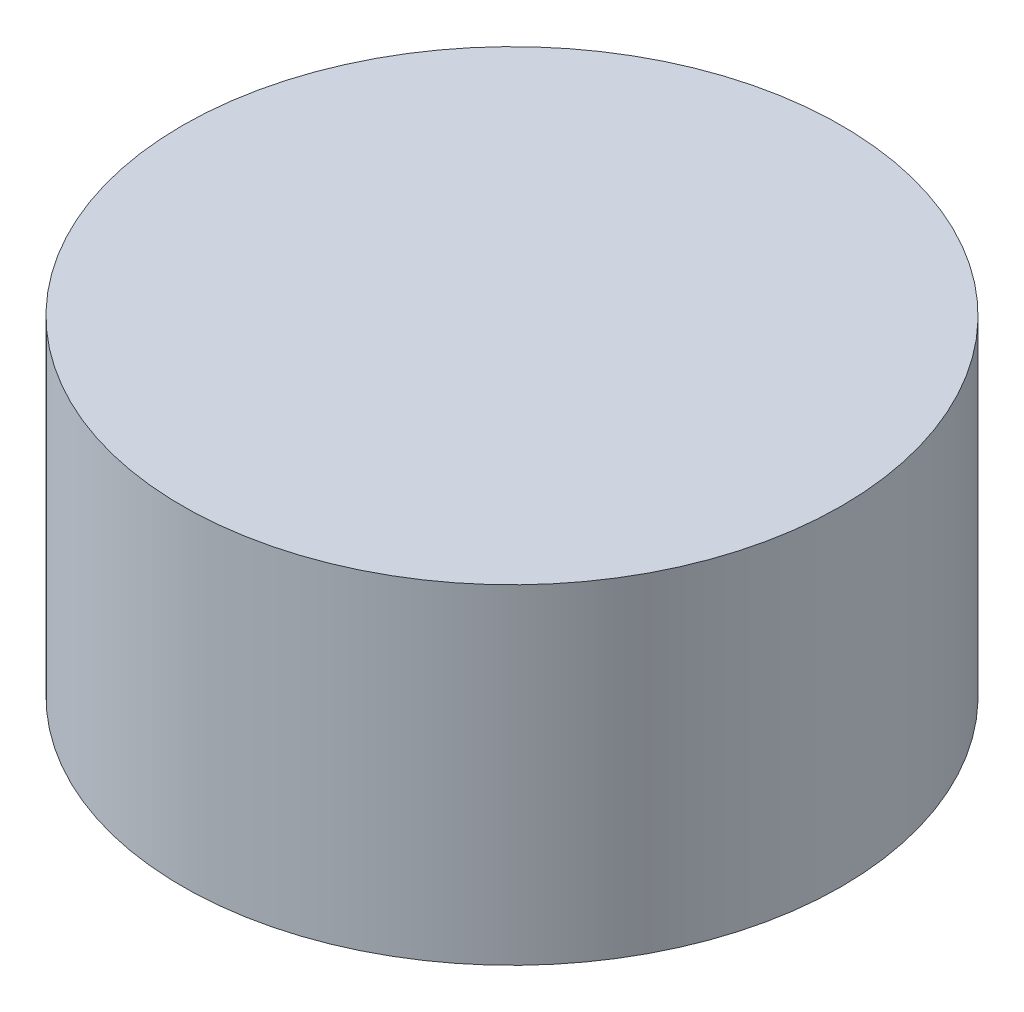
from build123d import *

# Parameters (mm, degrees)
SKETCH2_W           = 50
SKETCH2_H           = 50
BOSS_EXTRUDE1_DEPTH = 20
BOSS_EXTRUDE2_DEPTH = 20
CUT_EXTRUDE5_DEPTH  = 10
CUT_EXTRUDE6_DEPTH  = 10
SKETCH11_R          = 5
BOSS_EXTRUDE3_DEPTH = 20
FILLET1_R           = 5
FILLET2_R           = 5


with BuildPart() as part:
    # Sketch2 → Revolve1 (revolve)
    with BuildSketch(Plane.XY):
        with Locations((25, 25)):
            Rectangle(SKETCH2_W, SKETCH2_H)
    revolve(axis=Axis((0, 0, 0), (0, 1, 0)))

    # Sketch5 → Boss-Extrude1 (add)
    with BuildSketch(Plane.XY):
        Polygon((0, -15), (25, 0.131920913), (25, 15.131920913), (-25, 15.131920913), (-25, 0), align=None)
    extrude(amount=BOSS_EXTRUDE1_DEPTH)

    # Sketch6 → Boss-Extrude2 (add)
    with BuildSketch(Plane.XY):
        Polygon((0, -15), (25, 0.131920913), (25, 15.131920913), (-25, 15.131920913), (-25, 0), align=None)
    extrude(amount=-BOSS_EXTRUDE2_DEPTH)

    # Sketch9 → Cut-Extrude5 (cut)
    with BuildSketch(Plane.XY):
        Polygon((0, -15), (25, 0.131920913), (25, 15.131920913), (-25, 15.131920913), (-25, 0), align=None)
    extrude(amount=-CUT_EXTRUDE5_DEPTH, mode=Mode.SUBTRACT)

    # Sketch10 → Cut-Extrude6 (cut)
    with BuildSketch(Plane.XY):
        Polygon((0, -15), (25, 0.131920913), (25, 15.131920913), (-25, 15.131920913), (-25, 0), align=None)
    extrude(amount=CUT_EXTRUDE6_DEPTH, mode=Mode.SUBTRACT)

    # Sketch11 → Boss-Extrude3 (add)
    with BuildSketch(Plane.XY.offset(10)):
        with Locations((0, -5)):
            Circle(SKETCH11_R)
    extrude(amount=-BOSS_EXTRUDE3_DEPTH)

    # Fillet1
    fillet1_edges = [part.edges().sort_by_distance(p)[0] for p in [
        (0, -15, 15),
    ]]
    fillet(fillet1_edges, radius=FILLET1_R)

    # Fillet2
    fillet2_edges = [part.edges().sort_by_distance(p)[0] for p in [
        (0, -15, -15),
    ]]
    fillet(fillet2_edges, radius=FILLET2_R)


solid = part.part
